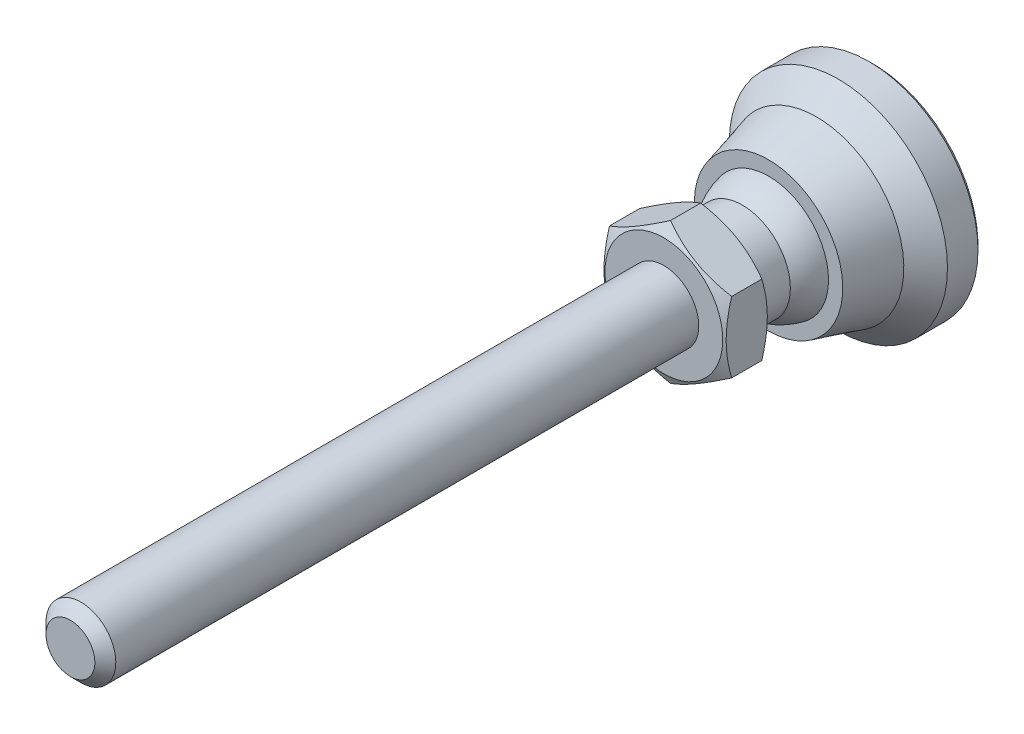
ISO-10303-21;
HEADER;
FILE_DESCRIPTION(('STEP AP214'),'2;1');
FILE_NAME('part.step','',(''),(''),'','','');
FILE_SCHEMA(('AUTOMOTIVE_DESIGN { 1 0 10303 214 1 1 1 1 }'));
ENDSEC;
DATA;
#1=APPLICATION_CONTEXT('core data for automotive mechanical design processes');
#2=APPLICATION_PROTOCOL_DEFINITION('international standard','automotive_design',2000,#1);
#3=PRODUCT_CONTEXT('',#1,'mechanical');
#4=PRODUCT('Part','Part','',(#3));
#5=PRODUCT_RELATED_PRODUCT_CATEGORY('part','',(#4));
#6=PRODUCT_DEFINITION_FORMATION('','',#4);
#7=PRODUCT_DEFINITION_CONTEXT('part definition',#1,'design');
#8=PRODUCT_DEFINITION('design','',#6,#7);
#9=PRODUCT_DEFINITION_SHAPE('','',#8);
#10=(LENGTH_UNIT() NAMED_UNIT(*) SI_UNIT(.MILLI.,.METRE.));
#11=(NAMED_UNIT(*) PLANE_ANGLE_UNIT() SI_UNIT($,.RADIAN.));
#12=(NAMED_UNIT(*) SI_UNIT($,.STERADIAN.) SOLID_ANGLE_UNIT());
#13=UNCERTAINTY_MEASURE_WITH_UNIT(LENGTH_MEASURE(1.E-05),#10,'distance_accuracy_value','');
#14=(GEOMETRIC_REPRESENTATION_CONTEXT(3) GLOBAL_UNCERTAINTY_ASSIGNED_CONTEXT((#13)) GLOBAL_UNIT_ASSIGNED_CONTEXT((#10,
#11,#12)) REPRESENTATION_CONTEXT('',''));
#15=CARTESIAN_POINT('',(0.,0.,0.));
#16=DIRECTION('',(0.,0.,1.));
#17=DIRECTION('',(1.,0.,0.));
#18=AXIS2_PLACEMENT_3D('',#15,#16,#17);
#19=CARTESIAN_POINT('',(12.,0.,0.));
#20=DIRECTION('',(0.,0.,1.));
#21=DIRECTION('',(0.,1.,0.));
#22=AXIS2_PLACEMENT_3D('',#19,#20,#21);
#23=PLANE('',#22);
#24=CARTESIAN_POINT('',(0.,0.,0.));
#25=DIRECTION('',(0.,0.,-1.));
#26=DIRECTION('',(0.,-1.,0.));
#27=AXIS2_PLACEMENT_3D('',#24,#25,#26);
#28=CIRCLE('',#27,12.);
#29=CARTESIAN_POINT('',(0.,-12.,0.));
#30=VERTEX_POINT('',#29);
#31=EDGE_CURVE('E95',#30,#30,#28,.T.);
#32=ORIENTED_EDGE('',*,*,#31,.T.);
#33=EDGE_LOOP('',(#32));
#34=FACE_BOUND('',#33,.T.);
#35=ADVANCED_FACE('F14',(#34),#23,.F.);
#36=CARTESIAN_POINT('',(5.49999999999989,0.,19.));
#37=DIRECTION('',(0.,0.,1.));
#38=DIRECTION('',(0.,1.,0.));
#39=AXIS2_PLACEMENT_3D('',#36,#37,#38);
#40=PLANE('',#39);
#41=CARTESIAN_POINT('',(0.,0.,19.));
#42=DIRECTION('',(0.,0.,1.));
#43=DIRECTION('',(0.,1.,0.));
#44=AXIS2_PLACEMENT_3D('',#41,#42,#43);
#45=CIRCLE('',#44,6.75);
#46=CARTESIAN_POINT('',(0.,6.75,19.));
#47=VERTEX_POINT('',#46);
#48=EDGE_CURVE('E439',#47,#47,#45,.T.);
#49=ORIENTED_EDGE('',*,*,#48,.F.);
#50=EDGE_LOOP('',(#49));
#51=FACE_BOUND('',#50,.T.);
#52=CARTESIAN_POINT('',(0.,0.,19.));
#53=DIRECTION('',(0.,0.,-1.));
#54=DIRECTION('',(0.,-1.,0.));
#55=AXIS2_PLACEMENT_3D('',#52,#53,#54);
#56=CIRCLE('',#55,5.49999999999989);
#57=CARTESIAN_POINT('',(0.,-5.49999999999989,19.));
#58=VERTEX_POINT('',#57);
#59=EDGE_CURVE('E116',#58,#58,#56,.T.);
#60=ORIENTED_EDGE('',*,*,#59,.F.);
#61=EDGE_LOOP('',(#60));
#62=FACE_BOUND('',#61,.T.);
#63=ADVANCED_FACE('F142',(#51,#62),#40,.F.);
#64=CARTESIAN_POINT('',(0.,0.,0.));
#65=DIRECTION('',(0.,0.,-1.));
#66=DIRECTION('',(0.,-1.,0.));
#67=AXIS2_PLACEMENT_3D('',#64,#65,#66);
#68=CYLINDRICAL_SURFACE('',#67,5.49999999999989);
#69=CARTESIAN_POINT('',(0.,0.,15.));
#70=DIRECTION('',(0.,0.,-1.));
#71=DIRECTION('',(0.,-1.,0.));
#72=AXIS2_PLACEMENT_3D('',#69,#70,#71);
#73=CIRCLE('',#72,5.49999999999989);
#74=CARTESIAN_POINT('',(5.49999999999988,0.,15.));
#75=VERTEX_POINT('',#74);
#76=EDGE_CURVE('E113',#75,#75,#73,.T.);
#77=ORIENTED_EDGE('',*,*,#76,.F.);
#78=EDGE_LOOP('',(#77));
#79=FACE_BOUND('',#78,.T.);
#80=ORIENTED_EDGE('',*,*,#59,.T.);
#81=EDGE_LOOP('',(#80));
#82=FACE_BOUND('',#81,.T.);
#83=ADVANCED_FACE('F148',(#79,#82),#68,.T.);
#84=CARTESIAN_POINT('',(-1.11022302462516E-13,0.,10.6698729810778));
#85=DIRECTION('',(0.,0.,-1.));
#86=DIRECTION('',(1.,0.,0.));
#87=AXIS2_PLACEMENT_3D('',#84,#85,#86);
#88=SPHERICAL_SURFACE('',#87,7.);
#89=CARTESIAN_POINT('',(0.,0.,12.));
#90=DIRECTION('',(0.,0.,-1.));
#91=DIRECTION('',(0.,-1.,0.));
#92=AXIS2_PLACEMENT_3D('',#89,#90,#91);
#93=CIRCLE('',#92,6.87246404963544);
#94=CARTESIAN_POINT('',(6.87246404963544,0.,12.));
#95=VERTEX_POINT('',#94);
#96=EDGE_CURVE('E110',#95,#95,#93,.T.);
#97=CARTESIAN_POINT('',(6.87246404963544,0.,12.));
#98=CARTESIAN_POINT('',(6.86587210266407,0.,12.0340591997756));
#99=CARTESIAN_POINT('',(6.85902692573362,0.,12.0680693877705));
#100=CARTESIAN_POINT('',(6.84483171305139,0.,12.1359842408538));
#101=CARTESIAN_POINT('',(6.83748167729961,0.,12.1698889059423));
#102=CARTESIAN_POINT('',(6.82227834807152,0.,12.2375852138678));
#103=CARTESIAN_POINT('',(6.81442505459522,0.,12.2713768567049));
#104=CARTESIAN_POINT('',(6.79821695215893,0.,12.3388396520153));
#105=CARTESIAN_POINT('',(6.78986214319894,0.,12.3725108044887));
#106=CARTESIAN_POINT('',(6.77265285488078,0.,12.4397251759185));
#107=CARTESIAN_POINT('',(6.76379837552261,0.,12.473268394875));
#108=CARTESIAN_POINT('',(6.7455917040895,0.,12.5402194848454));
#109=CARTESIAN_POINT('',(6.73623951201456,0.,12.5736273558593));
#110=CARTESIAN_POINT('',(6.71703948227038,0.,12.6403003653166));
#111=CARTESIAN_POINT('',(6.70719164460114,0.,12.67356550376));
#112=CARTESIAN_POINT('',(6.68700250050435,0.,12.7399456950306));
#113=CARTESIAN_POINT('',(6.6766611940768,0.,12.7730607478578));
#114=CARTESIAN_POINT('',(6.65548739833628,0.,12.8391334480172));
#115=CARTESIAN_POINT('',(6.64465490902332,0.,12.8720910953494));
#116=CARTESIAN_POINT('',(6.62250114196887,0.,12.9378416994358));
#117=CARTESIAN_POINT('',(6.61117986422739,0.,12.9706346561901));
#118=CARTESIAN_POINT('',(6.58805102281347,0.,13.0360486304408));
#119=CARTESIAN_POINT('',(6.57624345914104,0.,13.0686696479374));
#120=CARTESIAN_POINT('',(6.55214465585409,0.,13.1337325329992));
#121=CARTESIAN_POINT('',(6.53985341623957,0.,13.1661744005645));
#122=CARTESIAN_POINT('',(6.51478997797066,0.,13.2308718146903));
#123=CARTESIAN_POINT('',(6.50201777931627,0.,13.2631273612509));
#124=CARTESIAN_POINT('',(6.47599524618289,0.,13.3274450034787));
#125=CARTESIAN_POINT('',(6.46274491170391,0.,13.3595070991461));
#126=CARTESIAN_POINT('',(6.43576903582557,0.,13.4234307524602));
#127=CARTESIAN_POINT('',(6.42204349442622,0.,13.455292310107));
#128=CARTESIAN_POINT('',(6.3941202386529,0.,13.5188078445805));
#129=CARTESIAN_POINT('',(6.37992252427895,0.,13.5504618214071));
#130=CARTESIAN_POINT('',(6.3510580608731,0.,13.6135551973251));
#131=CARTESIAN_POINT('',(6.33639131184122,0.,13.6449945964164));
#132=CARTESIAN_POINT('',(6.3065920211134,0.,13.7076518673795));
#133=CARTESIAN_POINT('',(6.29145947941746,0.,13.7388697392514));
#134=CARTESIAN_POINT('',(6.26073194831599,0.,13.8010770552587));
#135=CARTESIAN_POINT('',(6.24513695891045,0.,13.8320664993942));
#136=CARTESIAN_POINT('',(6.21348797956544,0.,13.8938101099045));
#137=CARTESIAN_POINT('',(6.19743398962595,0.,13.9245642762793));
#138=CARTESIAN_POINT('',(6.16487055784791,0.,13.9858305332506));
#139=CARTESIAN_POINT('',(6.14836111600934,0.,14.016342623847));
#140=CARTESIAN_POINT('',(6.11489042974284,0.,14.0771179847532));
#141=CARTESIAN_POINT('',(6.09792918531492,0.,14.107381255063));
#142=CARTESIAN_POINT('',(6.06355864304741,0.,14.1676522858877));
#143=CARTESIAN_POINT('',(6.04614934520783,0.,14.1976600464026));
#144=CARTESIAN_POINT('',(6.01088654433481,0.,14.2574134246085));
#145=CARTESIAN_POINT('',(5.99303304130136,0.,14.2871590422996));
#146=CARTESIAN_POINT('',(5.95688577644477,0.,14.3463815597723));
#147=CARTESIAN_POINT('',(5.93859201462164,0.,14.3758584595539));
#148=CARTESIAN_POINT('',(5.9015682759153,0.,14.4345370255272));
#149=CARTESIAN_POINT('',(5.88283829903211,0.,14.4637386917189));
#150=CARTESIAN_POINT('',(5.8449462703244,0.,14.5218603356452));
#151=CARTESIAN_POINT('',(5.82578421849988,0.,14.5507803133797));
#152=CARTESIAN_POINT('',(5.7870322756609,0.,14.6083321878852));
#153=CARTESIAN_POINT('',(5.76744238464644,0.,14.6369640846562));
#154=CARTESIAN_POINT('',(5.72783909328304,0.,14.6939334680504));
#155=CARTESIAN_POINT('',(5.7078256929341,0.,14.7222709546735));
#156=CARTESIAN_POINT('',(5.66737980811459,0.,14.778645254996));
#157=CARTESIAN_POINT('',(5.64694732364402,0.,14.8066820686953));
#158=CARTESIAN_POINT('',(5.60566778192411,0.,14.862448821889));
#159=CARTESIAN_POINT('',(5.58482072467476,0.,14.8901787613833));
#160=CARTESIAN_POINT('',(5.54271666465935,0.,14.9453256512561));
#161=CARTESIAN_POINT('',(5.52145966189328,0.,14.9727426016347));
#162=CARTESIAN_POINT('',(5.49999999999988,0.,15.));
#163=B_SPLINE_CURVE_WITH_KNOTS('',3,(#97,#98,#99,#100,#101,#102,#103,#104,#105,#106,#107,#108,
#109,#110,#111,#112,#113,#114,#115,#116,#117,#118,#119,#120,#121,#122,#123,#124,#125,#126,#127,
#128,#129,#130,#131,#132,#133,#134,#135,#136,#137,#138,#139,#140,#141,#142,#143,#144,#145,#146,
#147,#148,#149,#150,#151,#152,#153,#154,#155,#156,#157,#158,#159,#160,#161,#162),.UNSPECIFIED.,
.F.,.F.,(4,2,2,2,2,2,2,2,2,2,2,2,2,2,2,2,2,2,2,2,2,2,2,2,2,2,2,2,2,2,2,2,4),(0.,
0.104072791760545,0.208145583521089,0.312218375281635,0.416291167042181,0.520363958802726,
0.62443675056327,0.728509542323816,0.83258233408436,0.936655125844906,1.04072791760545,
1.144800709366,1.24887350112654,1.35294629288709,1.45701908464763,1.56109187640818,
1.66516466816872,1.76923745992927,1.87331025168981,1.97738304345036,2.0814558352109,
2.18552862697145,2.28960141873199,2.39367421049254,2.49774700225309,2.60181979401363,
2.70589258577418,2.80996537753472,2.91403816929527,3.01811096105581,3.12218375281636,
3.2262565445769,3.33032933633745),.UNSPECIFIED.);
#164=EDGE_CURVE('BSEAM179',#95,#75,#163,.T.);
#165=ORIENTED_EDGE('',*,*,#96,.F.);
#166=ORIENTED_EDGE('',*,*,#76,.T.);
#167=ORIENTED_EDGE('',*,*,#164,.T.);
#168=ORIENTED_EDGE('',*,*,#164,.F.);
#169=EDGE_LOOP('',(#165,#167,#166,#168));
#170=FACE_BOUND('',#169,.T.);
#171=ADVANCED_FACE('F179',(#170),#88,.T.);
#172=CARTESIAN_POINT('',(8.5,0.,12.));
#173=DIRECTION('',(0.,0.,-1.));
#174=DIRECTION('',(0.,-1.,0.));
#175=AXIS2_PLACEMENT_3D('',#172,#173,#174);
#176=PLANE('',#175);
#177=CARTESIAN_POINT('',(0.,0.,12.));
#178=DIRECTION('',(0.,0.,-1.));
#179=DIRECTION('',(0.,-1.,0.));
#180=AXIS2_PLACEMENT_3D('',#177,#178,#179);
#181=CIRCLE('',#180,8.5);
#182=CARTESIAN_POINT('',(0.,-8.5,12.));
#183=VERTEX_POINT('',#182);
#184=EDGE_CURVE('E107',#183,#183,#181,.T.);
#185=ORIENTED_EDGE('',*,*,#184,.F.);
#186=EDGE_LOOP('',(#185));
#187=FACE_BOUND('',#186,.T.);
#188=ORIENTED_EDGE('',*,*,#96,.T.);
#189=EDGE_LOOP('',(#188));
#190=FACE_BOUND('',#189,.T.);
#191=ADVANCED_FACE('F173',(#187,#190),#176,.F.);
#192=CARTESIAN_POINT('',(0.,0.,12.));
#193=DIRECTION('',(0.,0.,-1.));
#194=DIRECTION('',(0.,-1.,0.));
#195=AXIS2_PLACEMENT_3D('',#192,#193,#194);
#196=CONICAL_SURFACE('',#195,8.5,0.266252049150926);
#197=CARTESIAN_POINT('',(0.,0.,6.5));
#198=DIRECTION('',(0.,0.,-1.));
#199=DIRECTION('',(0.,-1.,0.));
#200=AXIS2_PLACEMENT_3D('',#197,#198,#199);
#201=CIRCLE('',#200,10.);
#202=CARTESIAN_POINT('',(0.,-10.,6.5));
#203=VERTEX_POINT('',#202);
#204=EDGE_CURVE('E104',#203,#203,#201,.T.);
#205=ORIENTED_EDGE('',*,*,#204,.F.);
#206=EDGE_LOOP('',(#205));
#207=FACE_BOUND('',#206,.T.);
#208=ORIENTED_EDGE('',*,*,#184,.T.);
#209=EDGE_LOOP('',(#208));
#210=FACE_BOUND('',#209,.T.);
#211=ADVANCED_FACE('F167',(#207,#210),#196,.T.);
#212=CARTESIAN_POINT('',(0.,0.,6.5));
#213=DIRECTION('',(0.,0.,-1.));
#214=DIRECTION('',(0.,-1.,0.));
#215=AXIS2_PLACEMENT_3D('',#212,#213,#214);
#216=CONICAL_SURFACE('',#215,10.,0.785398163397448);
#217=CARTESIAN_POINT('',(0.,0.,4.));
#218=DIRECTION('',(0.,0.,-1.));
#219=DIRECTION('',(0.,-1.,0.));
#220=AXIS2_PLACEMENT_3D('',#217,#218,#219);
#221=CIRCLE('',#220,12.5);
#222=CARTESIAN_POINT('',(0.,-12.5,4.));
#223=VERTEX_POINT('',#222);
#224=EDGE_CURVE('E101',#223,#223,#221,.T.);
#225=ORIENTED_EDGE('',*,*,#224,.F.);
#226=EDGE_LOOP('',(#225));
#227=FACE_BOUND('',#226,.T.);
#228=ORIENTED_EDGE('',*,*,#204,.T.);
#229=EDGE_LOOP('',(#228));
#230=FACE_BOUND('',#229,.T.);
#231=ADVANCED_FACE('F161',(#227,#230),#216,.T.);
#232=CARTESIAN_POINT('',(0.,0.,0.));
#233=DIRECTION('',(0.,0.,-1.));
#234=DIRECTION('',(0.,-1.,0.));
#235=AXIS2_PLACEMENT_3D('',#232,#233,#234);
#236=CYLINDRICAL_SURFACE('',#235,12.5);
#237=CARTESIAN_POINT('',(0.,0.,0.5));
#238=DIRECTION('',(0.,0.,-1.));
#239=DIRECTION('',(0.,-1.,0.));
#240=AXIS2_PLACEMENT_3D('',#237,#238,#239);
#241=CIRCLE('',#240,12.5);
#242=CARTESIAN_POINT('',(0.,-12.5,0.5));
#243=VERTEX_POINT('',#242);
#244=EDGE_CURVE('E98',#243,#243,#241,.T.);
#245=ORIENTED_EDGE('',*,*,#244,.F.);
#246=EDGE_LOOP('',(#245));
#247=FACE_BOUND('',#246,.T.);
#248=ORIENTED_EDGE('',*,*,#224,.T.);
#249=EDGE_LOOP('',(#248));
#250=FACE_BOUND('',#249,.T.);
#251=ADVANCED_FACE('F155',(#247,#250),#236,.T.);
#252=CARTESIAN_POINT('',(0.,0.,0.5));
#253=DIRECTION('',(0.,0.,1.));
#254=DIRECTION('',(0.,1.,0.));
#255=AXIS2_PLACEMENT_3D('',#252,#253,#254);
#256=CONICAL_SURFACE('',#255,12.5,0.785398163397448);
#257=ORIENTED_EDGE('',*,*,#31,.F.);
#258=EDGE_LOOP('',(#257));
#259=FACE_BOUND('',#258,.T.);
#260=ORIENTED_EDGE('',*,*,#244,.T.);
#261=EDGE_LOOP('',(#260));
#262=FACE_BOUND('',#261,.T.);
#263=ADVANCED_FACE('F140',(#259,#262),#256,.T.);
#264=CARTESIAN_POINT('',(0.,0.,19.));
#265=DIRECTION('',(0.,0.,1.));
#266=DIRECTION('',(0.,1.,0.));
#267=AXIS2_PLACEMENT_3D('',#264,#265,#266);
#268=CONICAL_SURFACE('',#267,6.75,1.0471975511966);
#269=CARTESIAN_POINT('',(-0.000200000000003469,8.0830192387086,19.7696190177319));
#270=CARTESIAN_POINT('',(0.15366790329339,7.99418356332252,19.7183374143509));
#271=CARTESIAN_POINT('',(0.30810950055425,7.90501666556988,19.669383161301));
#272=CARTESIAN_POINT('',(0.618246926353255,7.72595873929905,19.5767703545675));
#273=CARTESIAN_POINT('',(0.773943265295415,7.63606741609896,19.5331140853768));
#274=CARTESIAN_POINT('',(1.24352516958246,7.36495417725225,19.4109491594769));
#275=CARTESIAN_POINT('',(1.5592643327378,7.18266208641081,19.3414631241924));
#276=CARTESIAN_POINT('',(2.03176224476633,6.90986528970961,19.2599825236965));
#277=CARTESIAN_POINT('',(2.18710922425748,6.82017566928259,19.2367710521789));
#278=CARTESIAN_POINT('',(2.49850511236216,6.64039116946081,19.1978487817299));
#279=CARTESIAN_POINT('',(2.65455395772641,6.55029632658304,19.1821373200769));
#280=CARTESIAN_POINT('',(2.96692267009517,6.36995016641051,19.1586154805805));
#281=CARTESIAN_POINT('',(3.12324202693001,6.27969914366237,19.1507961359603));
#282=CARTESIAN_POINT('',(3.43601650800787,6.09911871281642,19.1432178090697));
#283=CARTESIAN_POINT('',(3.59247162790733,6.00878930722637,19.1434585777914));
#284=CARTESIAN_POINT('',(4.02110687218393,5.76131663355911,19.155197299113));
#285=CARTESIAN_POINT('',(4.2931466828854,5.60425437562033,19.1749033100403));
#286=CARTESIAN_POINT('',(4.83541944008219,5.29117305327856,19.2373910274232));
#287=CARTESIAN_POINT('',(5.10565047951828,5.13515508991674,19.2801940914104));
#288=CARTESIAN_POINT('',(5.64901454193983,4.82144370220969,19.3871892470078));
#289=CARTESIAN_POINT('',(5.92207900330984,4.6637898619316,19.4518346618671));
#290=CARTESIAN_POINT('',(6.46413578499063,4.35083323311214,19.5985536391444));
#291=CARTESIAN_POINT('',(6.73313504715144,4.19552643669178,19.680592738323));
#292=CARTESIAN_POINT('',(7.0002,4.04133641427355,19.7696190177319));
#293=B_SPLINE_CURVE_WITH_KNOTS('',3,(#269,#270,#271,#272,#273,#274,#275,#276,#277,#278,#279,
#280,#281,#282,#283,#284,#285,#286,#287,#288,#289,#290,#291,#292),.UNSPECIFIED.,.F.,.F.,(4,2,2,
2,2,2,2,2,2,2,2,4),(0.,0.554727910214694,1.10969417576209,2.2219327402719,2.76443041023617,
3.30688013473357,3.8487128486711,4.39052882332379,5.33376515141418,6.27787517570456,
7.24292418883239,8.20607866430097),.UNSPECIFIED.);
#294=CARTESIAN_POINT('',(0.,8.08290376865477,19.7695523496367));
#295=VERTEX_POINT('',#294);
#296=CARTESIAN_POINT('',(7.,4.04145188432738,19.7695523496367));
#297=VERTEX_POINT('',#296);
#298=EDGE_CURVE('E72',#295,#297,#293,.T.);
#299=ORIENTED_EDGE('',*,*,#298,.T.);
#300=CARTESIAN_POINT('',(7.,-10.856511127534,22.5608530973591));
#301=CARTESIAN_POINT('',(7.,-10.550768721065,22.4125379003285));
#302=CARTESIAN_POINT('',(7.,-10.2443245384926,22.2656446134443));
#303=CARTESIAN_POINT('',(7.,-9.62965940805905,21.9755015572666));
#304=CARTESIAN_POINT('',(7.,-9.32143818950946,21.8322523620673));
#305=CARTESIAN_POINT('',(7.,-8.70125807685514,21.5494766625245));
#306=CARTESIAN_POINT('',(7.,-8.38928797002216,21.4099746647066));
#307=CARTESIAN_POINT('',(7.,-7.76286673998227,21.136678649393));
#308=CARTESIAN_POINT('',(7.,-7.44841573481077,21.0028843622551));
#309=CARTESIAN_POINT('',(7.,-6.80638109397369,20.7383277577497));
#310=CARTESIAN_POINT('',(7.,-6.47869996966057,20.6078007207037));
#311=CARTESIAN_POINT('',(7.,-5.81950512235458,20.356623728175));
#312=CARTESIAN_POINT('',(7.,-5.48799097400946,20.2359748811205));
#313=CARTESIAN_POINT('',(7.,-4.82121890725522,20.0077213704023));
#314=CARTESIAN_POINT('',(7.,-4.48597012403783,19.9000903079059));
#315=CARTESIAN_POINT('',(7.,-3.8106756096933,19.7013242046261));
#316=CARTESIAN_POINT('',(7.,-3.47063142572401,19.6101839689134));
#317=CARTESIAN_POINT('',(7.,-2.78738354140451,19.4492635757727));
#318=CARTESIAN_POINT('',(7.,-2.44420787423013,19.3793676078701));
#319=CARTESIAN_POINT('',(7.,-1.9263187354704,19.2934825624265));
#320=CARTESIAN_POINT('',(7.,-1.75315537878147,19.2680128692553));
#321=CARTESIAN_POINT('',(7.,-1.40596771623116,19.2238926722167));
#322=CARTESIAN_POINT('',(7.,-1.23194349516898,19.2052415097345));
#323=CARTESIAN_POINT('',(7.,-0.885541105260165,19.1753639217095));
#324=CARTESIAN_POINT('',(7.,-0.713171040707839,19.1640439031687));
#325=CARTESIAN_POINT('',(7.,-0.36810670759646,19.1487030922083));
#326=CARTESIAN_POINT('',(7.,-0.195412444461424,19.1446821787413));
#327=CARTESIAN_POINT('',(7.,0.149991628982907,19.1440354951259));
#328=CARTESIAN_POINT('',(7.,0.322701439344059,19.1474097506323));
#329=CARTESIAN_POINT('',(7.,0.667825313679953,19.1614709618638));
#330=CARTESIAN_POINT('',(7.,0.840239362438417,19.1721582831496));
#331=CARTESIAN_POINT('',(7.,1.25457859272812,19.206403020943));
#332=CARTESIAN_POINT('',(7.,1.49622315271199,19.2334288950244));
#333=CARTESIAN_POINT('',(7.,1.97770790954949,19.3003713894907));
#334=CARTESIAN_POINT('',(7.,2.21754785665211,19.3402897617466));
#335=CARTESIAN_POINT('',(7.,2.93409253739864,19.4772660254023));
#336=CARTESIAN_POINT('',(7.,3.40755293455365,19.5915198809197));
#337=CARTESIAN_POINT('',(7.,4.11550695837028,19.7895145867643));
#338=CARTESIAN_POINT('',(7.,4.35367593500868,19.8608684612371));
#339=CARTESIAN_POINT('',(7.,4.82770038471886,20.0109546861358));
#340=CARTESIAN_POINT('',(7.,5.06355584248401,20.089687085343));
#341=CARTESIAN_POINT('',(7.,5.53302810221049,20.2532698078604));
#342=CARTESIAN_POINT('',(7.,5.7666456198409,20.3381180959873));
#343=CARTESIAN_POINT('',(7.,6.23194719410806,20.512937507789));
#344=CARTESIAN_POINT('',(7.,6.46363127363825,20.6029085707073));
#345=CARTESIAN_POINT('',(7.,7.01140920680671,20.8214901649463));
#346=CARTESIAN_POINT('',(7.,7.32674648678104,20.9519932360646));
#347=CARTESIAN_POINT('',(7.,7.95473233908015,21.2193341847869));
#348=CARTESIAN_POINT('',(7.,8.26738074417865,21.3561724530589));
#349=CARTESIAN_POINT('',(7.,8.89048518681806,21.6349077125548));
#350=CARTESIAN_POINT('',(7.,9.20094076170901,21.7768057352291));
#351=CARTESIAN_POINT('',(7.,9.81997533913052,22.0646449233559));
#352=CARTESIAN_POINT('',(7.,10.1285543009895,22.2105861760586));
#353=CARTESIAN_POINT('',(7.,10.7444696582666,22.5059068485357));
#354=CARTESIAN_POINT('',(7.,11.0518043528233,22.6552898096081));
#355=CARTESIAN_POINT('',(7.,11.6651476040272,22.9567563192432));
#356=CARTESIAN_POINT('',(7.,11.9711561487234,23.1088398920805));
#357=CARTESIAN_POINT('',(7.,12.8874279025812,23.568380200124));
#358=CARTESIAN_POINT('',(7.,13.4960207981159,23.8791669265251));
#359=CARTESIAN_POINT('',(7.,14.6588217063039,24.4805256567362));
#360=CARTESIAN_POINT('',(7.,15.2132911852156,24.7705943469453));
#361=CARTESIAN_POINT('',(7.,16.3201726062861,25.3546761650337));
#362=CARTESIAN_POINT('',(7.,16.8725844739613,25.6486894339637));
#363=CARTESIAN_POINT('',(7.,17.9744182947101,26.2389760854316));
#364=CARTESIAN_POINT('',(7.,18.5238442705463,26.5352419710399));
#365=CARTESIAN_POINT('',(7.,19.6213814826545,27.1301276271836));
#366=CARTESIAN_POINT('',(7.,20.1694927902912,27.4287472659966));
#367=CARTESIAN_POINT('',(7.,20.7171206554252,27.7282449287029));
#368=B_SPLINE_CURVE_WITH_KNOTS('',3,(#300,#301,#302,#303,#304,#305,#306,#307,#308,#309,#310,
#311,#312,#313,#314,#315,#316,#317,#318,#319,#320,#321,#322,#323,#324,#325,#326,#327,#328,#329,
#330,#331,#332,#333,#334,#335,#336,#337,#338,#339,#340,#341,#342,#343,#344,#345,#346,#347,#348,
#349,#350,#351,#352,#353,#354,#355,#356,#357,#358,#359,#360,#361,#362,#363,#364,#365,#366,#367),
.UNSPECIFIED.,.F.,.F.,(4,2,2,2,2,2,2,2,2,2,2,2,2,2,2,2,2,2,2,2,2,2,2,2,2,2,2,2,2,2,2,2,2,4),(0.,
1.01946442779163,2.03908848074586,3.06426234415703,4.08938772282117,5.14742766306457,
6.20558616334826,7.26156150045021,8.31720360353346,9.36698329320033,9.89194948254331,
10.4168649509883,10.9349396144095,11.4530056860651,11.9710735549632,12.4891673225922,
13.2182088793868,13.9473495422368,15.40643828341,16.1522601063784,16.8980868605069,
17.6436665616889,18.3892374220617,19.4129689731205,20.4367637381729,21.4607684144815,
22.4847952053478,23.509927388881,24.535068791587,26.585073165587,28.4623378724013,
30.3396698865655,32.212304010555,34.0848340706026),.UNSPECIFIED.);
#369=CARTESIAN_POINT('',(7.,-4.04145188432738,19.7695523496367));
#370=VERTEX_POINT('',#369);
#371=EDGE_CURVE('E80',#297,#370,#368,.F.);
#372=ORIENTED_EDGE('',*,*,#371,.T.);
#373=CARTESIAN_POINT('',(7.0002,-4.04133641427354,19.7696190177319));
#374=CARTESIAN_POINT('',(6.84633209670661,-4.13017208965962,19.7183374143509));
#375=CARTESIAN_POINT('',(6.69189049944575,-4.21933898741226,19.669383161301));
#376=CARTESIAN_POINT('',(6.38175307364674,-4.39839691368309,19.5767703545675));
#377=CARTESIAN_POINT('',(6.22605673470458,-4.48828823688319,19.5331140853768));
#378=CARTESIAN_POINT('',(5.75647483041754,-4.75940147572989,19.4109491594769));
#379=CARTESIAN_POINT('',(5.4407356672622,-4.94169356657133,19.3414631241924));
#380=CARTESIAN_POINT('',(4.96823775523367,-5.21449036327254,19.2599825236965));
#381=CARTESIAN_POINT('',(4.81289077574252,-5.30417998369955,19.2367710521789));
#382=CARTESIAN_POINT('',(4.50149488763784,-5.48396448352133,19.1978487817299));
#383=CARTESIAN_POINT('',(4.34544604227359,-5.57405932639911,19.1821373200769));
#384=CARTESIAN_POINT('',(4.03307732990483,-5.75440548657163,19.1586154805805));
#385=CARTESIAN_POINT('',(3.87675797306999,-5.84465650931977,19.1507961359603));
#386=CARTESIAN_POINT('',(3.56398349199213,-6.02523694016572,19.1432178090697));
#387=CARTESIAN_POINT('',(3.40752837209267,-6.11556634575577,19.1434585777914));
#388=CARTESIAN_POINT('',(2.97889312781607,-6.36303901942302,19.155197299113));
#389=CARTESIAN_POINT('',(2.7068533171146,-6.52010127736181,19.1749033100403));
#390=CARTESIAN_POINT('',(2.16458055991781,-6.83318259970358,19.2373910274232));
#391=CARTESIAN_POINT('',(1.89434952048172,-6.9892005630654,19.2801940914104));
#392=CARTESIAN_POINT('',(1.35098545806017,-7.30291195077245,19.3871892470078));
#393=CARTESIAN_POINT('',(1.07792099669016,-7.46056579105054,19.4518346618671));
#394=CARTESIAN_POINT('',(0.535864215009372,-7.77352241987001,19.5985536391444));
#395=CARTESIAN_POINT('',(0.266864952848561,-7.92882921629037,19.680592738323));
#396=CARTESIAN_POINT('',(-0.000199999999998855,-8.0830192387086,19.7696190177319));
#397=B_SPLINE_CURVE_WITH_KNOTS('',3,(#373,#374,#375,#376,#377,#378,#379,#380,#381,#382,#383,
#384,#385,#386,#387,#388,#389,#390,#391,#392,#393,#394,#395,#396),.UNSPECIFIED.,.F.,.F.,(4,2,2,
2,2,2,2,2,2,2,2,4),(0.,0.554727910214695,1.10969417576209,2.2219327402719,2.76443041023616,
3.30688013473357,3.84871284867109,4.39052882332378,5.33376515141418,6.27787517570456,
7.2429241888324,8.20607866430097),.UNSPECIFIED.);
#398=CARTESIAN_POINT('',(0.,-8.08290376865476,19.7695523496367));
#399=VERTEX_POINT('',#398);
#400=EDGE_CURVE('E394',#370,#399,#397,.T.);
#401=ORIENTED_EDGE('',*,*,#400,.T.);
#402=CARTESIAN_POINT('',(0.000200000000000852,-8.0830192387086,19.7696190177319));
#403=CARTESIAN_POINT('',(-0.153667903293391,-7.99418356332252,19.7183374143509));
#404=CARTESIAN_POINT('',(-0.30810950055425,-7.90501666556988,19.669383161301));
#405=CARTESIAN_POINT('',(-0.618246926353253,-7.72595873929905,19.5767703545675));
#406=CARTESIAN_POINT('',(-0.773943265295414,-7.63606741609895,19.5331140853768));
#407=CARTESIAN_POINT('',(-1.24352516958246,-7.36495417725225,19.4109491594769));
#408=CARTESIAN_POINT('',(-1.5592643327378,-7.18266208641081,19.3414631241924));
#409=CARTESIAN_POINT('',(-2.03176224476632,-6.9098652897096,19.2599825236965));
#410=CARTESIAN_POINT('',(-2.18710922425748,-6.82017566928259,19.2367710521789));
#411=CARTESIAN_POINT('',(-2.49850511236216,-6.64039116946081,19.1978487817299));
#412=CARTESIAN_POINT('',(-2.6545539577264,-6.55029632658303,19.1821373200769));
#413=CARTESIAN_POINT('',(-2.96692267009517,-6.36995016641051,19.1586154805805));
#414=CARTESIAN_POINT('',(-3.12324202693,-6.27969914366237,19.1507961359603));
#415=CARTESIAN_POINT('',(-3.43601650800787,-6.09911871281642,19.1432178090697));
#416=CARTESIAN_POINT('',(-3.59247162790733,-6.00878930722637,19.1434585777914));
#417=CARTESIAN_POINT('',(-4.02110687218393,-5.76131663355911,19.155197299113));
#418=CARTESIAN_POINT('',(-4.29314668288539,-5.60425437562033,19.1749033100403));
#419=CARTESIAN_POINT('',(-4.83541944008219,-5.29117305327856,19.2373910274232));
#420=CARTESIAN_POINT('',(-5.10565047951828,-5.13515508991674,19.2801940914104));
#421=CARTESIAN_POINT('',(-5.64901454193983,-4.82144370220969,19.3871892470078));
#422=CARTESIAN_POINT('',(-5.92207900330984,-4.66378986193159,19.4518346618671));
#423=CARTESIAN_POINT('',(-6.46413578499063,-4.35083323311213,19.5985536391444));
#424=CARTESIAN_POINT('',(-6.73313504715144,-4.19552643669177,19.680592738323));
#425=CARTESIAN_POINT('',(-7.0002,-4.04133641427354,19.7696190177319));
#426=B_SPLINE_CURVE_WITH_KNOTS('',3,(#402,#403,#404,#405,#406,#407,#408,#409,#410,#411,#412,
#413,#414,#415,#416,#417,#418,#419,#420,#421,#422,#423,#424,#425),.UNSPECIFIED.,.F.,.F.,(4,2,2,
2,2,2,2,2,2,2,2,4),(0.,0.554727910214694,1.10969417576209,2.22193274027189,2.76443041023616,
3.30688013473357,3.84871284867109,4.39052882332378,5.33376515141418,6.27787517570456,
7.2429241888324,8.20607866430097),.UNSPECIFIED.);
#427=CARTESIAN_POINT('',(-7.,-4.04145188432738,19.7695523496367));
#428=VERTEX_POINT('',#427);
#429=EDGE_CURVE('E389',#399,#428,#426,.T.);
#430=ORIENTED_EDGE('',*,*,#429,.T.);
#431=CARTESIAN_POINT('',(-7.,-10.856511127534,22.5608530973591));
#432=CARTESIAN_POINT('',(-7.,-10.550768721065,22.4125379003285));
#433=CARTESIAN_POINT('',(-7.,-10.2443245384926,22.2656446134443));
#434=CARTESIAN_POINT('',(-7.,-9.62965940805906,21.9755015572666));
#435=CARTESIAN_POINT('',(-7.,-9.32143818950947,21.8322523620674));
#436=CARTESIAN_POINT('',(-7.,-8.70125807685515,21.5494766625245));
#437=CARTESIAN_POINT('',(-7.,-8.38928797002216,21.4099746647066));
#438=CARTESIAN_POINT('',(-7.,-7.76286673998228,21.136678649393));
#439=CARTESIAN_POINT('',(-7.,-7.44841573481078,21.0028843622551));
#440=CARTESIAN_POINT('',(-7.,-6.8063810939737,20.7383277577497));
#441=CARTESIAN_POINT('',(-7.,-6.47869996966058,20.6078007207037));
#442=CARTESIAN_POINT('',(-7.,-5.81950512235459,20.356623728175));
#443=CARTESIAN_POINT('',(-7.,-5.48799097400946,20.2359748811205));
#444=CARTESIAN_POINT('',(-7.,-4.82121890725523,20.0077213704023));
#445=CARTESIAN_POINT('',(-7.,-4.48597012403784,19.9000903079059));
#446=CARTESIAN_POINT('',(-7.,-3.81067560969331,19.7013242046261));
#447=CARTESIAN_POINT('',(-7.,-3.47063142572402,19.6101839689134));
#448=CARTESIAN_POINT('',(-7.,-2.78738354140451,19.4492635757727));
#449=CARTESIAN_POINT('',(-7.,-2.44420787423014,19.3793676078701));
#450=CARTESIAN_POINT('',(-7.,-1.92631873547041,19.2934825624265));
#451=CARTESIAN_POINT('',(-7.,-1.75315537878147,19.2680128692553));
#452=CARTESIAN_POINT('',(-7.,-1.40596771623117,19.2238926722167));
#453=CARTESIAN_POINT('',(-7.,-1.23194349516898,19.2052415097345));
#454=CARTESIAN_POINT('',(-7.,-0.885541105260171,19.1753639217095));
#455=CARTESIAN_POINT('',(-7.,-0.713171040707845,19.1640439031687));
#456=CARTESIAN_POINT('',(-7.,-0.368106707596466,19.1487030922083));
#457=CARTESIAN_POINT('',(-7.,-0.19541244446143,19.1446821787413));
#458=CARTESIAN_POINT('',(-7.,0.149991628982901,19.1440354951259));
#459=CARTESIAN_POINT('',(-7.,0.322701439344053,19.1474097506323));
#460=CARTESIAN_POINT('',(-7.,0.667825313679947,19.1614709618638));
#461=CARTESIAN_POINT('',(-7.,0.840239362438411,19.1721582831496));
#462=CARTESIAN_POINT('',(-7.,1.25457859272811,19.206403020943));
#463=CARTESIAN_POINT('',(-7.,1.49622315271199,19.2334288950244));
#464=CARTESIAN_POINT('',(-7.,1.97770790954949,19.3003713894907));
#465=CARTESIAN_POINT('',(-7.,2.2175478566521,19.3402897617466));
#466=CARTESIAN_POINT('',(-7.,2.93409253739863,19.4772660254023));
#467=CARTESIAN_POINT('',(-7.,3.40755293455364,19.5915198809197));
#468=CARTESIAN_POINT('',(-7.,4.11550695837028,19.7895145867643));
#469=CARTESIAN_POINT('',(-7.,4.35367593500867,19.8608684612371));
#470=CARTESIAN_POINT('',(-7.,4.82770038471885,20.0109546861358));
#471=CARTESIAN_POINT('',(-7.,5.06355584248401,20.089687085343));
#472=CARTESIAN_POINT('',(-7.,5.53302810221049,20.2532698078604));
#473=CARTESIAN_POINT('',(-7.,5.76664561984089,20.3381180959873));
#474=CARTESIAN_POINT('',(-7.,6.23194719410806,20.512937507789));
#475=CARTESIAN_POINT('',(-7.,6.46363127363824,20.6029085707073));
#476=CARTESIAN_POINT('',(-7.,7.0114092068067,20.8214901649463));
#477=CARTESIAN_POINT('',(-7.,7.32674648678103,20.9519932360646));
#478=CARTESIAN_POINT('',(-7.,7.95473233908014,21.2193341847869));
#479=CARTESIAN_POINT('',(-7.,8.26738074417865,21.3561724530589));
#480=CARTESIAN_POINT('',(-7.,8.89048518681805,21.6349077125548));
#481=CARTESIAN_POINT('',(-7.,9.200940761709,21.7768057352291));
#482=CARTESIAN_POINT('',(-7.,9.81997533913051,22.0646449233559));
#483=CARTESIAN_POINT('',(-7.,10.1285543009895,22.2105861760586));
#484=CARTESIAN_POINT('',(-7.,10.7444696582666,22.5059068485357));
#485=CARTESIAN_POINT('',(-7.,11.0518043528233,22.6552898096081));
#486=CARTESIAN_POINT('',(-7.,11.6651476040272,22.9567563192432));
#487=CARTESIAN_POINT('',(-7.,11.9711561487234,23.1088398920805));
#488=CARTESIAN_POINT('',(-7.,12.8874279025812,23.568380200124));
#489=CARTESIAN_POINT('',(-7.,13.4960207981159,23.8791669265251));
#490=CARTESIAN_POINT('',(-7.,14.658821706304,24.4805256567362));
#491=CARTESIAN_POINT('',(-7.,15.2132911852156,24.7705943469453));
#492=CARTESIAN_POINT('',(-7.,16.3201726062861,25.3546761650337));
#493=CARTESIAN_POINT('',(-7.,16.8725844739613,25.6486894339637));
#494=CARTESIAN_POINT('',(-7.,17.9744182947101,26.2389760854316));
#495=CARTESIAN_POINT('',(-7.,18.5238442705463,26.5352419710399));
#496=CARTESIAN_POINT('',(-7.,19.6213814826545,27.1301276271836));
#497=CARTESIAN_POINT('',(-7.,20.1694927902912,27.4287472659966));
#498=CARTESIAN_POINT('',(-7.,20.7171206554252,27.7282449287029));
#499=B_SPLINE_CURVE_WITH_KNOTS('',3,(#431,#432,#433,#434,#435,#436,#437,#438,#439,#440,#441,
#442,#443,#444,#445,#446,#447,#448,#449,#450,#451,#452,#453,#454,#455,#456,#457,#458,#459,#460,
#461,#462,#463,#464,#465,#466,#467,#468,#469,#470,#471,#472,#473,#474,#475,#476,#477,#478,#479,
#480,#481,#482,#483,#484,#485,#486,#487,#488,#489,#490,#491,#492,#493,#494,#495,#496,#497,#498),
.UNSPECIFIED.,.F.,.F.,(4,2,2,2,2,2,2,2,2,2,2,2,2,2,2,2,2,2,2,2,2,2,2,2,2,2,2,2,2,2,2,2,2,4),(0.,
1.01946442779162,2.03908848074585,3.06426234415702,4.08938772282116,5.14742766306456,
6.20558616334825,7.26156150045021,8.31720360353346,9.36698329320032,9.8919494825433,
10.4168649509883,10.9349396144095,11.4530056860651,11.9710735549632,12.4891673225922,
13.2182088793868,13.9473495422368,15.40643828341,16.1522601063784,16.8980868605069,
17.6436665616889,18.3892374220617,19.4129689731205,20.4367637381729,21.4607684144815,
22.4847952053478,23.509927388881,24.535068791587,26.585073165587,28.4623378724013,
30.3396698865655,32.212304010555,34.0848340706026),.UNSPECIFIED.);
#500=CARTESIAN_POINT('',(-7.,4.04145188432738,19.7695523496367));
#501=VERTEX_POINT('',#500);
#502=EDGE_CURVE('E33',#428,#501,#499,.T.);
#503=ORIENTED_EDGE('',*,*,#502,.T.);
#504=CARTESIAN_POINT('',(-7.0002,4.04133641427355,19.7696190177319));
#505=CARTESIAN_POINT('',(-6.84633209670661,4.13017208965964,19.7183374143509));
#506=CARTESIAN_POINT('',(-6.69189049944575,4.21933898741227,19.669383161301));
#507=CARTESIAN_POINT('',(-6.38175307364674,4.3983969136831,19.5767703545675));
#508=CARTESIAN_POINT('',(-6.22605673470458,4.4882882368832,19.5331140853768));
#509=CARTESIAN_POINT('',(-5.75647483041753,4.7594014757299,19.4109491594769));
#510=CARTESIAN_POINT('',(-5.4407356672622,4.94169356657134,19.3414631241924));
#511=CARTESIAN_POINT('',(-4.96823775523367,5.21449036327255,19.2599825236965));
#512=CARTESIAN_POINT('',(-4.81289077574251,5.30417998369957,19.2367710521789));
#513=CARTESIAN_POINT('',(-4.50149488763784,5.48396448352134,19.1978487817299));
#514=CARTESIAN_POINT('',(-4.34544604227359,5.57405932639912,19.1821373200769));
#515=CARTESIAN_POINT('',(-4.03307732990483,5.75440548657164,19.1586154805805));
#516=CARTESIAN_POINT('',(-3.87675797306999,5.84465650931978,19.1507961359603));
#517=CARTESIAN_POINT('',(-3.56398349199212,6.02523694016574,19.1432178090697));
#518=CARTESIAN_POINT('',(-3.40752837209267,6.11556634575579,19.1434585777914));
#519=CARTESIAN_POINT('',(-2.97889312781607,6.36303901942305,19.155197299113));
#520=CARTESIAN_POINT('',(-2.7068533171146,6.52010127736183,19.1749033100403));
#521=CARTESIAN_POINT('',(-2.1645805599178,6.83318259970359,19.2373910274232));
#522=CARTESIAN_POINT('',(-1.89434952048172,6.98920056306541,19.2801940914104));
#523=CARTESIAN_POINT('',(-1.35098545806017,7.30291195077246,19.3871892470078));
#524=CARTESIAN_POINT('',(-1.07792099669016,7.46056579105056,19.4518346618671));
#525=CARTESIAN_POINT('',(-0.535864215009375,7.77352241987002,19.5985536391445));
#526=CARTESIAN_POINT('',(-0.266864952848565,7.92882921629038,19.680592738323));
#527=CARTESIAN_POINT('',(0.000199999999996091,8.08301923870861,19.7696190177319));
#528=B_SPLINE_CURVE_WITH_KNOTS('',3,(#504,#505,#506,#507,#508,#509,#510,#511,#512,#513,#514,
#515,#516,#517,#518,#519,#520,#521,#522,#523,#524,#525,#526,#527),.UNSPECIFIED.,.F.,.F.,(4,2,2,
2,2,2,2,2,2,2,2,4),(0.,0.554727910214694,1.10969417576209,2.2219327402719,2.76443041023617,
3.30688013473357,3.84871284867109,4.39052882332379,5.33376515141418,6.27787517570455,
7.24292418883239,8.20607866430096),.UNSPECIFIED.);
#529=EDGE_CURVE('E9',#501,#295,#528,.T.);
#530=ORIENTED_EDGE('',*,*,#529,.T.);
#531=EDGE_LOOP('',(#299,#372,#401,#430,#503,#530));
#532=FACE_BOUND('',#531,.T.);
#533=ORIENTED_EDGE('',*,*,#48,.T.);
#534=EDGE_LOOP('',(#533));
#535=FACE_BOUND('',#534,.T.);
#536=ADVANCED_FACE('F70',(#532,#535),#268,.T.);
#537=CARTESIAN_POINT('',(2.8,0.,92.));
#538=DIRECTION('',(0.,0.,-1.));
#539=DIRECTION('',(0.,-1.,0.));
#540=AXIS2_PLACEMENT_3D('',#537,#538,#539);
#541=PLANE('',#540);
#542=CARTESIAN_POINT('',(0.,0.,92.));
#543=DIRECTION('',(0.,0.,-1.));
#544=DIRECTION('',(0.,-1.,0.));
#545=AXIS2_PLACEMENT_3D('',#542,#543,#544);
#546=CIRCLE('',#545,2.8);
#547=CARTESIAN_POINT('',(0.,-2.8,92.));
#548=VERTEX_POINT('',#547);
#549=EDGE_CURVE('E27',#548,#548,#546,.T.);
#550=ORIENTED_EDGE('',*,*,#549,.F.);
#551=EDGE_LOOP('',(#550));
#552=FACE_BOUND('',#551,.T.);
#553=ADVANCED_FACE('F129',(#552),#541,.F.);
#554=CARTESIAN_POINT('',(0.,0.,92.));
#555=DIRECTION('',(0.,0.,-1.));
#556=DIRECTION('',(0.,-1.,0.));
#557=AXIS2_PLACEMENT_3D('',#554,#555,#556);
#558=CONICAL_SURFACE('',#557,2.8,0.785398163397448);
#559=CARTESIAN_POINT('',(0.,0.,90.8));
#560=DIRECTION('',(0.,0.,-1.));
#561=DIRECTION('',(0.,-1.,0.));
#562=AXIS2_PLACEMENT_3D('',#559,#560,#561);
#563=CIRCLE('',#562,4.);
#564=CARTESIAN_POINT('',(0.,-4.,90.8));
#565=VERTEX_POINT('',#564);
#566=EDGE_CURVE('E122',#565,#565,#563,.T.);
#567=ORIENTED_EDGE('',*,*,#566,.F.);
#568=EDGE_LOOP('',(#567));
#569=FACE_BOUND('',#568,.T.);
#570=ORIENTED_EDGE('',*,*,#549,.T.);
#571=EDGE_LOOP('',(#570));
#572=FACE_BOUND('',#571,.T.);
#573=ADVANCED_FACE('F127',(#569,#572),#558,.T.);
#574=CARTESIAN_POINT('',(0.,0.,0.));
#575=DIRECTION('',(0.,0.,-1.));
#576=DIRECTION('',(0.,-1.,0.));
#577=AXIS2_PLACEMENT_3D('',#574,#575,#576);
#578=CYLINDRICAL_SURFACE('',#577,4.);
#579=CARTESIAN_POINT('',(0.,0.,24.));
#580=DIRECTION('',(0.,0.,-1.));
#581=DIRECTION('',(0.,-1.,0.));
#582=AXIS2_PLACEMENT_3D('',#579,#580,#581);
#583=CIRCLE('',#582,4.);
#584=CARTESIAN_POINT('',(0.,-4.,24.));
#585=VERTEX_POINT('',#584);
#586=EDGE_CURVE('E119',#585,#585,#583,.T.);
#587=ORIENTED_EDGE('',*,*,#586,.F.);
#588=EDGE_LOOP('',(#587));
#589=FACE_BOUND('',#588,.T.);
#590=ORIENTED_EDGE('',*,*,#566,.T.);
#591=EDGE_LOOP('',(#590));
#592=FACE_BOUND('',#591,.T.);
#593=ADVANCED_FACE('F137',(#589,#592),#578,.T.);
#594=CARTESIAN_POINT('',(4.,0.,24.));
#595=DIRECTION('',(0.,0.,-1.));
#596=DIRECTION('',(0.,-1.,0.));
#597=AXIS2_PLACEMENT_3D('',#594,#595,#596);
#598=PLANE('',#597);
#599=CARTESIAN_POINT('',(0.,0.,24.));
#600=DIRECTION('',(0.,0.,1.));
#601=DIRECTION('',(0.,1.,0.));
#602=AXIS2_PLACEMENT_3D('',#599,#600,#601);
#603=CIRCLE('',#602,6.75);
#604=CARTESIAN_POINT('',(0.,6.75,24.));
#605=VERTEX_POINT('',#604);
#606=EDGE_CURVE('E79',#605,#605,#603,.T.);
#607=ORIENTED_EDGE('',*,*,#606,.T.);
#608=EDGE_LOOP('',(#607));
#609=FACE_BOUND('',#608,.T.);
#610=ORIENTED_EDGE('',*,*,#586,.T.);
#611=EDGE_LOOP('',(#610));
#612=FACE_BOUND('',#611,.T.);
#613=ADVANCED_FACE('F197',(#609,#612),#598,.F.);
#614=CARTESIAN_POINT('',(0.,0.,22.0956820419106));
#615=DIRECTION('',(0.,0.,-1.));
#616=DIRECTION('',(0.,-1.,0.));
#617=AXIS2_PLACEMENT_3D('',#614,#615,#616);
#618=CONICAL_SURFACE('',#617,10.0483754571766,1.0471975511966);
#619=CARTESIAN_POINT('',(7.0002,4.04133641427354,23.2303809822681));
#620=CARTESIAN_POINT('',(6.84633209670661,4.13017208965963,23.2816625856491));
#621=CARTESIAN_POINT('',(6.69189049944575,4.21933898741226,23.330616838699));
#622=CARTESIAN_POINT('',(6.38175307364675,4.39839691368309,23.4232296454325));
#623=CARTESIAN_POINT('',(6.22605673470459,4.48828823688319,23.4668859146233));
#624=CARTESIAN_POINT('',(5.75647483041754,4.75940147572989,23.5890508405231));
#625=CARTESIAN_POINT('',(5.4407356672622,4.94169356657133,23.6585368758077));
#626=CARTESIAN_POINT('',(4.96823775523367,5.21449036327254,23.7400174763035));
#627=CARTESIAN_POINT('',(4.81289077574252,5.30417998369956,23.7632289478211));
#628=CARTESIAN_POINT('',(4.50149488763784,5.48396448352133,23.8021512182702));
#629=CARTESIAN_POINT('',(4.3454460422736,5.57405932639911,23.8178626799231));
#630=CARTESIAN_POINT('',(4.03307732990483,5.75440548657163,23.8413845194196));
#631=CARTESIAN_POINT('',(3.87675797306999,5.84465650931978,23.8492038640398));
#632=CARTESIAN_POINT('',(3.56398349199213,6.02523694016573,23.8567821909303));
#633=CARTESIAN_POINT('',(3.40752837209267,6.11556634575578,23.8565414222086));
#634=CARTESIAN_POINT('',(2.97889312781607,6.36303901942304,23.844802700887));
#635=CARTESIAN_POINT('',(2.7068533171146,6.52010127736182,23.8250966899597));
#636=CARTESIAN_POINT('',(2.1645805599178,6.83318259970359,23.7626089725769));
#637=CARTESIAN_POINT('',(1.89434952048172,6.98920056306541,23.7198059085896));
#638=CARTESIAN_POINT('',(1.35098545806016,7.30291195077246,23.6128107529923));
#639=CARTESIAN_POINT('',(1.07792099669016,7.46056579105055,23.5481653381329));
#640=CARTESIAN_POINT('',(0.535864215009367,7.77352241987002,23.4014463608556));
#641=CARTESIAN_POINT('',(0.266864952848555,7.92882921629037,23.3194072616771));
#642=CARTESIAN_POINT('',(-0.000200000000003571,8.0830192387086,23.2303809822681));
#643=B_SPLINE_CURVE_WITH_KNOTS('',3,(#619,#620,#621,#622,#623,#624,#625,#626,#627,#628,#629,
#630,#631,#632,#633,#634,#635,#636,#637,#638,#639,#640,#641,#642),.UNSPECIFIED.,.F.,.F.,(4,2,2,
2,2,2,2,2,2,2,2,4),(0.,0.554727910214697,1.10969417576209,2.2219327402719,2.76443041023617,
3.30688013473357,3.8487128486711,4.39052882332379,5.33376515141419,6.27787517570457,
7.24292418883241,8.20607866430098),.UNSPECIFIED.);
#644=CARTESIAN_POINT('',(7.,4.04145188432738,23.2304476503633));
#645=VERTEX_POINT('',#644);
#646=CARTESIAN_POINT('',(0.,8.08290376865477,23.2304476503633));
#647=VERTEX_POINT('',#646);
#648=EDGE_CURVE('E87',#645,#647,#643,.T.);
#649=ORIENTED_EDGE('',*,*,#648,.T.);
#650=CARTESIAN_POINT('',(0.000199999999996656,8.08301923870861,23.2303809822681));
#651=CARTESIAN_POINT('',(-0.153667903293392,7.99418356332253,23.2816625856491));
#652=CARTESIAN_POINT('',(-0.308109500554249,7.9050166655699,23.330616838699));
#653=CARTESIAN_POINT('',(-0.618246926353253,7.72595873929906,23.4232296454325));
#654=CARTESIAN_POINT('',(-0.773943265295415,7.63606741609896,23.4668859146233));
#655=CARTESIAN_POINT('',(-1.24352516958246,7.36495417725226,23.5890508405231));
#656=CARTESIAN_POINT('',(-1.5592643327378,7.18266208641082,23.6585368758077));
#657=CARTESIAN_POINT('',(-2.03176224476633,6.90986528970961,23.7400174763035));
#658=CARTESIAN_POINT('',(-2.18710922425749,6.8201756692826,23.7632289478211));
#659=CARTESIAN_POINT('',(-2.49850511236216,6.64039116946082,23.8021512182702));
#660=CARTESIAN_POINT('',(-2.65455395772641,6.55029632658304,23.8178626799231));
#661=CARTESIAN_POINT('',(-2.96692267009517,6.36995016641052,23.8413845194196));
#662=CARTESIAN_POINT('',(-3.12324202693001,6.27969914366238,23.8492038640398));
#663=CARTESIAN_POINT('',(-3.43601650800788,6.09911871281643,23.8567821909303));
#664=CARTESIAN_POINT('',(-3.59247162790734,6.00878930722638,23.8565414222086));
#665=CARTESIAN_POINT('',(-4.02110687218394,5.76131663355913,23.844802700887));
#666=CARTESIAN_POINT('',(-4.2931466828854,5.60425437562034,23.8250966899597));
#667=CARTESIAN_POINT('',(-4.8354194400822,5.29117305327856,23.7626089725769));
#668=CARTESIAN_POINT('',(-5.10565047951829,5.13515508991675,23.7198059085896));
#669=CARTESIAN_POINT('',(-5.64901454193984,4.8214437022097,23.6128107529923));
#670=CARTESIAN_POINT('',(-5.92207900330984,4.6637898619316,23.5481653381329));
#671=CARTESIAN_POINT('',(-6.46413578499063,4.35083323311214,23.4014463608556));
#672=CARTESIAN_POINT('',(-6.73313504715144,4.19552643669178,23.319407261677));
#673=CARTESIAN_POINT('',(-7.0002,4.04133641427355,23.2303809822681));
#674=B_SPLINE_CURVE_WITH_KNOTS('',3,(#650,#651,#652,#653,#654,#655,#656,#657,#658,#659,#660,
#661,#662,#663,#664,#665,#666,#667,#668,#669,#670,#671,#672,#673),.UNSPECIFIED.,.F.,.F.,(4,2,2,
2,2,2,2,2,2,2,2,4),(0.,0.554727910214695,1.10969417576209,2.2219327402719,2.76443041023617,
3.30688013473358,3.8487128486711,4.39052882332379,5.33376515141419,6.27787517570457,
7.2429241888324,8.20607866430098),.UNSPECIFIED.);
#675=CARTESIAN_POINT('',(-7.,4.04145188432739,23.2304476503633));
#676=VERTEX_POINT('',#675);
#677=EDGE_CURVE('E85',#647,#676,#674,.T.);
#678=ORIENTED_EDGE('',*,*,#677,.T.);
#679=CARTESIAN_POINT('',(-7.,-10.856511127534,20.4391469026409));
#680=CARTESIAN_POINT('',(-7.,-10.550768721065,20.5874620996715));
#681=CARTESIAN_POINT('',(-7.,-10.2443245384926,20.7343553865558));
#682=CARTESIAN_POINT('',(-7.,-9.62965940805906,21.0244984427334));
#683=CARTESIAN_POINT('',(-7.,-9.32143818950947,21.1677476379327));
#684=CARTESIAN_POINT('',(-7.,-8.70125807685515,21.4505233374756));
#685=CARTESIAN_POINT('',(-7.,-8.38928797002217,21.5900253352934));
#686=CARTESIAN_POINT('',(-7.,-7.76286673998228,21.863321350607));
#687=CARTESIAN_POINT('',(-7.,-7.44841573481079,21.9971156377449));
#688=CARTESIAN_POINT('',(-7.,-6.80638109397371,22.2616722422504));
#689=CARTESIAN_POINT('',(-7.,-6.47869996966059,22.3921992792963));
#690=CARTESIAN_POINT('',(-7.,-5.8195051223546,22.643376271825));
#691=CARTESIAN_POINT('',(-7.,-5.48799097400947,22.7640251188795));
#692=CARTESIAN_POINT('',(-7.,-4.82121890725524,22.9922786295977));
#693=CARTESIAN_POINT('',(-7.,-4.48597012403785,23.0999096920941));
#694=CARTESIAN_POINT('',(-7.,-3.81067560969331,23.2986757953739));
#695=CARTESIAN_POINT('',(-7.,-3.47063142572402,23.3898160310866));
#696=CARTESIAN_POINT('',(-7.,-2.78738354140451,23.5507364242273));
#697=CARTESIAN_POINT('',(-7.,-2.44420787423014,23.6206323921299));
#698=CARTESIAN_POINT('',(-7.,-1.92631873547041,23.7065174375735));
#699=CARTESIAN_POINT('',(-7.,-1.75315537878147,23.7319871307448));
#700=CARTESIAN_POINT('',(-7.,-1.40596771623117,23.7761073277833));
#701=CARTESIAN_POINT('',(-7.,-1.23194349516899,23.7947584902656));
#702=CARTESIAN_POINT('',(-7.,-0.885541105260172,23.8246360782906));
#703=CARTESIAN_POINT('',(-7.,-0.713171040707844,23.8359560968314));
#704=CARTESIAN_POINT('',(-7.,-0.368106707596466,23.8512969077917));
#705=CARTESIAN_POINT('',(-7.,-0.19541244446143,23.8553178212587));
#706=CARTESIAN_POINT('',(-7.,0.149991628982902,23.8559645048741));
#707=CARTESIAN_POINT('',(-7.,0.322701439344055,23.8525902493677));
#708=CARTESIAN_POINT('',(-7.,0.667825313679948,23.8385290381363));
#709=CARTESIAN_POINT('',(-7.,0.840239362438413,23.8278417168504));
#710=CARTESIAN_POINT('',(-7.,1.25457859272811,23.793596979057));
#711=CARTESIAN_POINT('',(-7.,1.49622315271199,23.7665711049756));
#712=CARTESIAN_POINT('',(-7.,1.9777079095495,23.6996286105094));
#713=CARTESIAN_POINT('',(-7.,2.21754785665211,23.6597102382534));
#714=CARTESIAN_POINT('',(-7.,2.93409253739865,23.5227339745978));
#715=CARTESIAN_POINT('',(-7.,3.40755293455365,23.4084801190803));
#716=CARTESIAN_POINT('',(-7.,4.11550695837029,23.2104854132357));
#717=CARTESIAN_POINT('',(-7.,4.35367593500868,23.139131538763));
#718=CARTESIAN_POINT('',(-7.,4.82770038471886,22.9890453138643));
#719=CARTESIAN_POINT('',(-7.,5.06355584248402,22.9103129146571));
#720=CARTESIAN_POINT('',(-7.,5.5330281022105,22.7467301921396));
#721=CARTESIAN_POINT('',(-7.,5.76664561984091,22.6618819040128));
#722=CARTESIAN_POINT('',(-7.,6.23194719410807,22.487062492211));
#723=CARTESIAN_POINT('',(-7.,6.46363127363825,22.3970914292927));
#724=CARTESIAN_POINT('',(-7.,7.01140920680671,22.1785098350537));
#725=CARTESIAN_POINT('',(-7.,7.32674648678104,22.0480067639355));
#726=CARTESIAN_POINT('',(-7.,7.95473233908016,21.7806658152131));
#727=CARTESIAN_POINT('',(-7.,8.26738074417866,21.6438275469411));
#728=CARTESIAN_POINT('',(-7.,8.89048518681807,21.3650922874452));
#729=CARTESIAN_POINT('',(-7.,9.20094076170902,21.2231942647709));
#730=CARTESIAN_POINT('',(-7.,9.81997533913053,20.9353550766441));
#731=CARTESIAN_POINT('',(-7.,10.1285543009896,20.7894138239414));
#732=CARTESIAN_POINT('',(-7.,10.7444696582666,20.4940931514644));
#733=CARTESIAN_POINT('',(-7.,11.0518043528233,20.3447101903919));
#734=CARTESIAN_POINT('',(-7.,11.6651476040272,20.0432436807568));
#735=CARTESIAN_POINT('',(-7.,11.9711561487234,19.8911601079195));
#736=CARTESIAN_POINT('',(-7.,12.8874279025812,19.431619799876));
#737=CARTESIAN_POINT('',(-7.,13.4960207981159,19.1208330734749));
#738=CARTESIAN_POINT('',(-7.,14.658821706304,18.5194743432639));
#739=CARTESIAN_POINT('',(-7.,15.2132911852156,18.2294056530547));
#740=CARTESIAN_POINT('',(-7.,16.3201726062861,17.6453238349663));
#741=CARTESIAN_POINT('',(-7.,16.8725844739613,17.3513105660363));
#742=CARTESIAN_POINT('',(-7.,17.9744182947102,16.7610239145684));
#743=CARTESIAN_POINT('',(-7.,18.5238442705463,16.4647580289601));
#744=CARTESIAN_POINT('',(-7.,19.6213814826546,15.8698723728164));
#745=CARTESIAN_POINT('',(-7.,20.1694927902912,15.5712527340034));
#746=CARTESIAN_POINT('',(-7.,20.7171206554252,15.2717550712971));
#747=B_SPLINE_CURVE_WITH_KNOTS('',3,(#679,#680,#681,#682,#683,#684,#685,#686,#687,#688,#689,
#690,#691,#692,#693,#694,#695,#696,#697,#698,#699,#700,#701,#702,#703,#704,#705,#706,#707,#708,
#709,#710,#711,#712,#713,#714,#715,#716,#717,#718,#719,#720,#721,#722,#723,#724,#725,#726,#727,
#728,#729,#730,#731,#732,#733,#734,#735,#736,#737,#738,#739,#740,#741,#742,#743,#744,#745,#746),
.UNSPECIFIED.,.F.,.F.,(4,2,2,2,2,2,2,2,2,2,2,2,2,2,2,2,2,2,2,2,2,2,2,2,2,2,2,2,2,2,2,2,2,4),(0.,
1.01946442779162,2.03908848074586,3.06426234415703,4.08938772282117,5.14742766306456,
6.20558616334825,7.26156150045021,8.31720360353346,9.36698329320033,9.89194948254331,
10.4168649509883,10.9349396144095,11.4530056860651,11.9710735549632,12.4891673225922,
13.2182088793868,13.9473495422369,15.40643828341,16.1522601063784,16.8980868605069,
17.6436665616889,18.3892374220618,19.4129689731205,20.4367637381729,21.4607684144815,
22.4847952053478,23.509927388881,24.535068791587,26.5850731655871,28.4623378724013,
30.3396698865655,32.2123040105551,34.0848340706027),.UNSPECIFIED.);
#748=CARTESIAN_POINT('',(-7.,-4.04145188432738,23.2304476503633));
#749=VERTEX_POINT('',#748);
#750=EDGE_CURVE('E434',#676,#749,#747,.F.);
#751=ORIENTED_EDGE('',*,*,#750,.T.);
#752=CARTESIAN_POINT('',(-7.0002,-4.04133641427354,23.2303809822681));
#753=CARTESIAN_POINT('',(-6.84633209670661,-4.13017208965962,23.2816625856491));
#754=CARTESIAN_POINT('',(-6.69189049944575,-4.21933898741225,23.330616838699));
#755=CARTESIAN_POINT('',(-6.38175307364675,-4.39839691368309,23.4232296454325));
#756=CARTESIAN_POINT('',(-6.22605673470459,-4.48828823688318,23.4668859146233));
#757=CARTESIAN_POINT('',(-5.75647483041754,-4.75940147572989,23.5890508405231));
#758=CARTESIAN_POINT('',(-5.4407356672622,-4.94169356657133,23.6585368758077));
#759=CARTESIAN_POINT('',(-4.96823775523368,-5.21449036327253,23.7400174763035));
#760=CARTESIAN_POINT('',(-4.81289077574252,-5.30417998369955,23.7632289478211));
#761=CARTESIAN_POINT('',(-4.50149488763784,-5.48396448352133,23.8021512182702));
#762=CARTESIAN_POINT('',(-4.3454460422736,-5.5740593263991,23.8178626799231));
#763=CARTESIAN_POINT('',(-4.03307732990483,-5.75440548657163,23.8413845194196));
#764=CARTESIAN_POINT('',(-3.87675797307,-5.84465650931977,23.8492038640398));
#765=CARTESIAN_POINT('',(-3.56398349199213,-6.02523694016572,23.8567821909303));
#766=CARTESIAN_POINT('',(-3.40752837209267,-6.11556634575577,23.8565414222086));
#767=CARTESIAN_POINT('',(-2.97889312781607,-6.36303901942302,23.844802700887));
#768=CARTESIAN_POINT('',(-2.7068533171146,-6.52010127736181,23.8250966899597));
#769=CARTESIAN_POINT('',(-2.1645805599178,-6.83318259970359,23.7626089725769));
#770=CARTESIAN_POINT('',(-1.89434952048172,-6.9892005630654,23.7198059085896));
#771=CARTESIAN_POINT('',(-1.35098545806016,-7.30291195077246,23.6128107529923));
#772=CARTESIAN_POINT('',(-1.07792099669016,-7.46056579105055,23.548165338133));
#773=CARTESIAN_POINT('',(-0.535864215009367,-7.77352241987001,23.4014463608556));
#774=CARTESIAN_POINT('',(-0.266864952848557,-7.92882921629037,23.3194072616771));
#775=CARTESIAN_POINT('',(0.000200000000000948,-8.0830192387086,23.2303809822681));
#776=B_SPLINE_CURVE_WITH_KNOTS('',3,(#752,#753,#754,#755,#756,#757,#758,#759,#760,#761,#762,
#763,#764,#765,#766,#767,#768,#769,#770,#771,#772,#773,#774,#775),.UNSPECIFIED.,.F.,.F.,(4,2,2,
2,2,2,2,2,2,2,2,4),(0.,0.554727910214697,1.10969417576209,2.2219327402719,2.76443041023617,
3.30688013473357,3.8487128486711,4.39052882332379,5.33376515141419,6.27787517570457,
7.24292418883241,8.20607866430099),.UNSPECIFIED.);
#777=CARTESIAN_POINT('',(0.,-8.08290376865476,23.2304476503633));
#778=VERTEX_POINT('',#777);
#779=EDGE_CURVE('E411',#749,#778,#776,.T.);
#780=ORIENTED_EDGE('',*,*,#779,.T.);
#781=CARTESIAN_POINT('',(-0.000199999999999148,-8.0830192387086,23.2303809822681));
#782=CARTESIAN_POINT('',(0.153667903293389,-7.99418356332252,23.2816625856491));
#783=CARTESIAN_POINT('',(0.308109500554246,-7.90501666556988,23.330616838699));
#784=CARTESIAN_POINT('',(0.61824692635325,-7.72595873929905,23.4232296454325));
#785=CARTESIAN_POINT('',(0.773943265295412,-7.63606741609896,23.4668859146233));
#786=CARTESIAN_POINT('',(1.24352516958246,-7.36495417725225,23.5890508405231));
#787=CARTESIAN_POINT('',(1.5592643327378,-7.18266208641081,23.6585368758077));
#788=CARTESIAN_POINT('',(2.03176224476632,-6.9098652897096,23.7400174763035));
#789=CARTESIAN_POINT('',(2.18710922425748,-6.82017566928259,23.7632289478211));
#790=CARTESIAN_POINT('',(2.49850511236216,-6.64039116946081,23.8021512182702));
#791=CARTESIAN_POINT('',(2.6545539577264,-6.55029632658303,23.8178626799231));
#792=CARTESIAN_POINT('',(2.96692267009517,-6.36995016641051,23.8413845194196));
#793=CARTESIAN_POINT('',(3.12324202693,-6.27969914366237,23.8492038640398));
#794=CARTESIAN_POINT('',(3.43601650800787,-6.09911871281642,23.8567821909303));
#795=CARTESIAN_POINT('',(3.59247162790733,-6.00878930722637,23.8565414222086));
#796=CARTESIAN_POINT('',(4.02110687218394,-5.76131663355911,23.844802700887));
#797=CARTESIAN_POINT('',(4.2931466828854,-5.60425437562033,23.8250966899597));
#798=CARTESIAN_POINT('',(4.8354194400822,-5.29117305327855,23.7626089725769));
#799=CARTESIAN_POINT('',(5.10565047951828,-5.13515508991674,23.7198059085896));
#800=CARTESIAN_POINT('',(5.64901454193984,-4.82144370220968,23.6128107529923));
#801=CARTESIAN_POINT('',(5.92207900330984,-4.66378986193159,23.548165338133));
#802=CARTESIAN_POINT('',(6.46413578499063,-4.35083323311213,23.4014463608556));
#803=CARTESIAN_POINT('',(6.73313504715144,-4.19552643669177,23.3194072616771));
#804=CARTESIAN_POINT('',(7.0002,-4.04133641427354,23.2303809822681));
#805=B_SPLINE_CURVE_WITH_KNOTS('',3,(#781,#782,#783,#784,#785,#786,#787,#788,#789,#790,#791,
#792,#793,#794,#795,#796,#797,#798,#799,#800,#801,#802,#803,#804),.UNSPECIFIED.,.F.,.F.,(4,2,2,
2,2,2,2,2,2,2,2,4),(0.,0.554727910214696,1.10969417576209,2.2219327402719,2.76443041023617,
3.30688013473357,3.8487128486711,4.39052882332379,5.33376515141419,6.27787517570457,
7.24292418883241,8.20607866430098),.UNSPECIFIED.);
#806=CARTESIAN_POINT('',(7.,-4.04145188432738,23.2304476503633));
#807=VERTEX_POINT('',#806);
#808=EDGE_CURVE('E404',#778,#807,#805,.T.);
#809=ORIENTED_EDGE('',*,*,#808,.T.);
#810=CARTESIAN_POINT('',(7.,-10.856511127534,20.4391469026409));
#811=CARTESIAN_POINT('',(7.,-10.550768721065,20.5874620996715));
#812=CARTESIAN_POINT('',(7.,-10.2443245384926,20.7343553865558));
#813=CARTESIAN_POINT('',(7.,-9.62965940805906,21.0244984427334));
#814=CARTESIAN_POINT('',(7.,-9.32143818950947,21.1677476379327));
#815=CARTESIAN_POINT('',(7.,-8.70125807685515,21.4505233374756));
#816=CARTESIAN_POINT('',(7.,-8.38928797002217,21.5900253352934));
#817=CARTESIAN_POINT('',(7.,-7.76286673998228,21.863321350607));
#818=CARTESIAN_POINT('',(7.,-7.44841573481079,21.9971156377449));
#819=CARTESIAN_POINT('',(7.,-6.8063810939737,22.2616722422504));
#820=CARTESIAN_POINT('',(7.,-6.47869996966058,22.3921992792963));
#821=CARTESIAN_POINT('',(7.,-5.8195051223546,22.643376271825));
#822=CARTESIAN_POINT('',(7.,-5.48799097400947,22.7640251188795));
#823=CARTESIAN_POINT('',(7.,-4.82121890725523,22.9922786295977));
#824=CARTESIAN_POINT('',(7.,-4.48597012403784,23.0999096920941));
#825=CARTESIAN_POINT('',(7.,-3.81067560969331,23.2986757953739));
#826=CARTESIAN_POINT('',(7.,-3.47063142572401,23.3898160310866));
#827=CARTESIAN_POINT('',(7.,-2.78738354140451,23.5507364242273));
#828=CARTESIAN_POINT('',(7.,-2.44420787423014,23.6206323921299));
#829=CARTESIAN_POINT('',(7.,-1.92631873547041,23.7065174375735));
#830=CARTESIAN_POINT('',(7.,-1.75315537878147,23.7319871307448));
#831=CARTESIAN_POINT('',(7.,-1.40596771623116,23.7761073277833));
#832=CARTESIAN_POINT('',(7.,-1.23194349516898,23.7947584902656));
#833=CARTESIAN_POINT('',(7.,-0.885541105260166,23.8246360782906));
#834=CARTESIAN_POINT('',(7.,-0.713171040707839,23.8359560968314));
#835=CARTESIAN_POINT('',(7.,-0.36810670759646,23.8512969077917));
#836=CARTESIAN_POINT('',(7.,-0.195412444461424,23.8553178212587));
#837=CARTESIAN_POINT('',(7.,0.149991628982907,23.8559645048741));
#838=CARTESIAN_POINT('',(7.,0.32270143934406,23.8525902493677));
#839=CARTESIAN_POINT('',(7.,0.667825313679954,23.8385290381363));
#840=CARTESIAN_POINT('',(7.,0.840239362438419,23.8278417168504));
#841=CARTESIAN_POINT('',(7.,1.25457859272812,23.793596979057));
#842=CARTESIAN_POINT('',(7.,1.496223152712,23.7665711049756));
#843=CARTESIAN_POINT('',(7.,1.97770790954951,23.6996286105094));
#844=CARTESIAN_POINT('',(7.,2.21754785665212,23.6597102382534));
#845=CARTESIAN_POINT('',(7.,2.93409253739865,23.5227339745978));
#846=CARTESIAN_POINT('',(7.,3.40755293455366,23.4084801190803));
#847=CARTESIAN_POINT('',(7.,4.1155069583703,23.2104854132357));
#848=CARTESIAN_POINT('',(7.,4.35367593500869,23.139131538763));
#849=CARTESIAN_POINT('',(7.,4.82770038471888,22.9890453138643));
#850=CARTESIAN_POINT('',(7.,5.06355584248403,22.9103129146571));
#851=CARTESIAN_POINT('',(7.,5.53302810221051,22.7467301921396));
#852=CARTESIAN_POINT('',(7.,5.76664561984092,22.6618819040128));
#853=CARTESIAN_POINT('',(7.,6.23194719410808,22.487062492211));
#854=CARTESIAN_POINT('',(7.,6.46363127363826,22.3970914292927));
#855=CARTESIAN_POINT('',(7.,7.01140920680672,22.1785098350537));
#856=CARTESIAN_POINT('',(7.,7.32674648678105,22.0480067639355));
#857=CARTESIAN_POINT('',(7.,7.95473233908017,21.7806658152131));
#858=CARTESIAN_POINT('',(7.,8.26738074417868,21.6438275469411));
#859=CARTESIAN_POINT('',(7.,8.89048518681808,21.3650922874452));
#860=CARTESIAN_POINT('',(7.,9.20094076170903,21.2231942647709));
#861=CARTESIAN_POINT('',(7.,9.81997533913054,20.9353550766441));
#862=CARTESIAN_POINT('',(7.,10.1285543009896,20.7894138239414));
#863=CARTESIAN_POINT('',(7.,10.7444696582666,20.4940931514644));
#864=CARTESIAN_POINT('',(7.,11.0518043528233,20.3447101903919));
#865=CARTESIAN_POINT('',(7.,11.6651476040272,20.0432436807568));
#866=CARTESIAN_POINT('',(7.,11.9711561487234,19.8911601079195));
#867=CARTESIAN_POINT('',(7.,12.8874279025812,19.431619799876));
#868=CARTESIAN_POINT('',(7.,13.4960207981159,19.1208330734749));
#869=CARTESIAN_POINT('',(7.,14.658821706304,18.5194743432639));
#870=CARTESIAN_POINT('',(7.,15.2132911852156,18.2294056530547));
#871=CARTESIAN_POINT('',(7.,16.3201726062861,17.6453238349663));
#872=CARTESIAN_POINT('',(7.,16.8725844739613,17.3513105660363));
#873=CARTESIAN_POINT('',(7.,17.9744182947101,16.7610239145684));
#874=CARTESIAN_POINT('',(7.,18.5238442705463,16.4647580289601));
#875=CARTESIAN_POINT('',(7.,19.6213814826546,15.8698723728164));
#876=CARTESIAN_POINT('',(7.,20.1694927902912,15.5712527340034));
#877=CARTESIAN_POINT('',(7.,20.7171206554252,15.2717550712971));
#878=B_SPLINE_CURVE_WITH_KNOTS('',3,(#810,#811,#812,#813,#814,#815,#816,#817,#818,#819,#820,
#821,#822,#823,#824,#825,#826,#827,#828,#829,#830,#831,#832,#833,#834,#835,#836,#837,#838,#839,
#840,#841,#842,#843,#844,#845,#846,#847,#848,#849,#850,#851,#852,#853,#854,#855,#856,#857,#858,
#859,#860,#861,#862,#863,#864,#865,#866,#867,#868,#869,#870,#871,#872,#873,#874,#875,#876,#877),
.UNSPECIFIED.,.F.,.F.,(4,2,2,2,2,2,2,2,2,2,2,2,2,2,2,2,2,2,2,2,2,2,2,2,2,2,2,2,2,2,2,2,2,4),(0.,
1.01946442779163,2.03908848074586,3.06426234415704,4.08938772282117,5.14742766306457,
6.20558616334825,7.26156150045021,8.31720360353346,9.36698329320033,9.89194948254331,
10.4168649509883,10.9349396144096,11.4530056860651,11.9710735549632,12.4891673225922,
13.2182088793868,13.9473495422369,15.40643828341,16.1522601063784,16.8980868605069,
17.643666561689,18.3892374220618,19.4129689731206,20.4367637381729,21.4607684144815,
22.4847952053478,23.509927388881,24.535068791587,26.5850731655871,28.4623378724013,
30.3396698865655,32.2123040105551,34.0848340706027),.UNSPECIFIED.);
#879=EDGE_CURVE('E91',#807,#645,#878,.T.);
#880=ORIENTED_EDGE('',*,*,#879,.T.);
#881=EDGE_LOOP('',(#649,#678,#751,#780,#809,#880));
#882=FACE_BOUND('',#881,.T.);
#883=ORIENTED_EDGE('',*,*,#606,.F.);
#884=EDGE_LOOP('',(#883));
#885=FACE_BOUND('',#884,.T.);
#886=ADVANCED_FACE('F200',(#882,#885),#618,.T.);
#887=CARTESIAN_POINT('',(0.,8.08290376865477,19.));
#888=DIRECTION('',(-0.5,0.866025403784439,0.));
#889=DIRECTION('',(-0.866025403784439,-0.5,0.));
#890=AXIS2_PLACEMENT_3D('',#887,#888,#889);
#891=PLANE('',#890);
#892=ORIENTED_EDGE('',*,*,#529,.F.);
#893=DIRECTION('',(0.,0.,1.));
#894=VECTOR('',#893,1.);
#895=CARTESIAN_POINT('',(-7.,4.04145188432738,19.));
#896=LINE('',#895,#894);
#897=EDGE_CURVE('E86',#501,#676,#896,.T.);
#898=ORIENTED_EDGE('',*,*,#897,.T.);
#899=ORIENTED_EDGE('',*,*,#677,.F.);
#900=DIRECTION('',(0.,0.,1.));
#901=VECTOR('',#900,1.);
#902=CARTESIAN_POINT('',(0.,8.08290376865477,19.));
#903=LINE('',#902,#901);
#904=EDGE_CURVE('E41',#295,#647,#903,.T.);
#905=ORIENTED_EDGE('',*,*,#904,.F.);
#906=EDGE_LOOP('',(#892,#898,#899,#905));
#907=FACE_BOUND('',#906,.T.);
#908=ADVANCED_FACE('F83',(#907),#891,.T.);
#909=CARTESIAN_POINT('',(-7.,4.04145188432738,19.));
#910=DIRECTION('',(-1.,0.,0.));
#911=DIRECTION('',(0.,-1.,0.));
#912=AXIS2_PLACEMENT_3D('',#909,#910,#911);
#913=PLANE('',#912);
#914=ORIENTED_EDGE('',*,*,#502,.F.);
#915=DIRECTION('',(0.,0.,1.));
#916=VECTOR('',#915,1.);
#917=CARTESIAN_POINT('',(-7.,-4.04145188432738,19.));
#918=LINE('',#917,#916);
#919=EDGE_CURVE('E89',#428,#749,#918,.T.);
#920=ORIENTED_EDGE('',*,*,#919,.T.);
#921=ORIENTED_EDGE('',*,*,#750,.F.);
#922=ORIENTED_EDGE('',*,*,#897,.F.);
#923=EDGE_LOOP('',(#914,#920,#921,#922));
#924=FACE_BOUND('',#923,.T.);
#925=ADVANCED_FACE('F237',(#924),#913,.T.);
#926=CARTESIAN_POINT('',(-7.,-4.04145188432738,19.));
#927=DIRECTION('',(-0.5,-0.866025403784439,0.));
#928=DIRECTION('',(0.866025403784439,-0.5,0.));
#929=AXIS2_PLACEMENT_3D('',#926,#927,#928);
#930=PLANE('',#929);
#931=ORIENTED_EDGE('',*,*,#429,.F.);
#932=DIRECTION('',(0.,0.,1.));
#933=VECTOR('',#932,1.);
#934=CARTESIAN_POINT('',(0.,-8.08290376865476,19.));
#935=LINE('',#934,#933);
#936=EDGE_CURVE('E428',#399,#778,#935,.T.);
#937=ORIENTED_EDGE('',*,*,#936,.T.);
#938=ORIENTED_EDGE('',*,*,#779,.F.);
#939=ORIENTED_EDGE('',*,*,#919,.F.);
#940=EDGE_LOOP('',(#931,#937,#938,#939));
#941=FACE_BOUND('',#940,.T.);
#942=ADVANCED_FACE('F244',(#941),#930,.T.);
#943=CARTESIAN_POINT('',(0.,-8.08290376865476,19.));
#944=DIRECTION('',(0.5,-0.866025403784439,0.));
#945=DIRECTION('',(0.866025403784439,0.5,0.));
#946=AXIS2_PLACEMENT_3D('',#943,#944,#945);
#947=PLANE('',#946);
#948=ORIENTED_EDGE('',*,*,#400,.F.);
#949=DIRECTION('',(0.,0.,1.));
#950=VECTOR('',#949,1.);
#951=CARTESIAN_POINT('',(7.,-4.04145188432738,19.));
#952=LINE('',#951,#950);
#953=EDGE_CURVE('E427',#370,#807,#952,.T.);
#954=ORIENTED_EDGE('',*,*,#953,.T.);
#955=ORIENTED_EDGE('',*,*,#808,.F.);
#956=ORIENTED_EDGE('',*,*,#936,.F.);
#957=EDGE_LOOP('',(#948,#954,#955,#956));
#958=FACE_BOUND('',#957,.T.);
#959=ADVANCED_FACE('F253',(#958),#947,.T.);
#960=CARTESIAN_POINT('',(7.,-4.04145188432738,19.));
#961=DIRECTION('',(1.,0.,0.));
#962=DIRECTION('',(0.,1.,0.));
#963=AXIS2_PLACEMENT_3D('',#960,#961,#962);
#964=PLANE('',#963);
#965=ORIENTED_EDGE('',*,*,#371,.F.);
#966=DIRECTION('',(0.,0.,1.));
#967=VECTOR('',#966,1.);
#968=CARTESIAN_POINT('',(7.,4.04145188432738,19.));
#969=LINE('',#968,#967);
#970=EDGE_CURVE('E78',#297,#645,#969,.T.);
#971=ORIENTED_EDGE('',*,*,#970,.T.);
#972=ORIENTED_EDGE('',*,*,#879,.F.);
#973=ORIENTED_EDGE('',*,*,#953,.F.);
#974=EDGE_LOOP('',(#965,#971,#972,#973));
#975=FACE_BOUND('',#974,.T.);
#976=ADVANCED_FACE('F262',(#975),#964,.T.);
#977=CARTESIAN_POINT('',(7.,4.04145188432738,19.));
#978=DIRECTION('',(0.5,0.866025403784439,0.));
#979=DIRECTION('',(-0.866025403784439,0.5,0.));
#980=AXIS2_PLACEMENT_3D('',#977,#978,#979);
#981=PLANE('',#980);
#982=ORIENTED_EDGE('',*,*,#298,.F.);
#983=ORIENTED_EDGE('',*,*,#904,.T.);
#984=ORIENTED_EDGE('',*,*,#648,.F.);
#985=ORIENTED_EDGE('',*,*,#970,.F.);
#986=EDGE_LOOP('',(#982,#983,#984,#985));
#987=FACE_BOUND('',#986,.T.);
#988=ADVANCED_FACE('F77',(#987),#981,.T.);
#989=CLOSED_SHELL('',(#35,#63,#83,#171,#191,#211,#231,#251,#263,#536,#553,#573,#593,#613,#886,
#908,#925,#942,#959,#976,#988));
#990=MANIFOLD_SOLID_BREP('B1',#989);
#991=ADVANCED_BREP_SHAPE_REPRESENTATION('',(#18,#990),#14);
#992=SHAPE_DEFINITION_REPRESENTATION(#9,#991);
ENDSEC;
END-ISO-10303-21;
